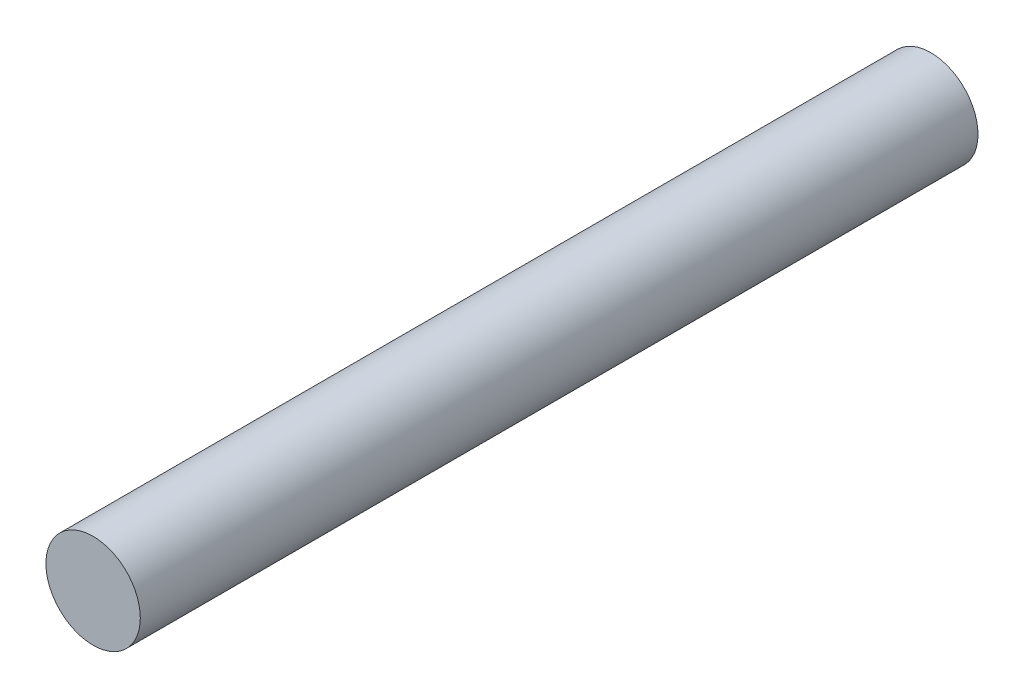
ISO-10303-21;
HEADER;
FILE_DESCRIPTION(('STEP AP214'),'2;1');
FILE_NAME('part.step','',(''),(''),'','','');
FILE_SCHEMA(('AUTOMOTIVE_DESIGN { 1 0 10303 214 1 1 1 1 }'));
ENDSEC;
DATA;
#1=APPLICATION_CONTEXT('core data for automotive mechanical design processes');
#2=APPLICATION_PROTOCOL_DEFINITION('international standard','automotive_design',2000,#1);
#3=PRODUCT_CONTEXT('',#1,'mechanical');
#4=PRODUCT('Part','Part','',(#3));
#5=PRODUCT_RELATED_PRODUCT_CATEGORY('part','',(#4));
#6=PRODUCT_DEFINITION_FORMATION('','',#4);
#7=PRODUCT_DEFINITION_CONTEXT('part definition',#1,'design');
#8=PRODUCT_DEFINITION('design','',#6,#7);
#9=PRODUCT_DEFINITION_SHAPE('','',#8);
#10=(LENGTH_UNIT() NAMED_UNIT(*) SI_UNIT(.MILLI.,.METRE.));
#11=(NAMED_UNIT(*) PLANE_ANGLE_UNIT() SI_UNIT($,.RADIAN.));
#12=(NAMED_UNIT(*) SI_UNIT($,.STERADIAN.) SOLID_ANGLE_UNIT());
#13=UNCERTAINTY_MEASURE_WITH_UNIT(LENGTH_MEASURE(1.E-05),#10,'distance_accuracy_value','');
#14=(GEOMETRIC_REPRESENTATION_CONTEXT(3) GLOBAL_UNCERTAINTY_ASSIGNED_CONTEXT((#13)) GLOBAL_UNIT_ASSIGNED_CONTEXT((#10,
#11,#12)) REPRESENTATION_CONTEXT('',''));
#15=CARTESIAN_POINT('',(0.,0.,0.));
#16=DIRECTION('',(0.,0.,1.));
#17=DIRECTION('',(1.,0.,0.));
#18=AXIS2_PLACEMENT_3D('',#15,#16,#17);
#19=CARTESIAN_POINT('',(-31.1913765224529,8.09595084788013,71.));
#20=DIRECTION('',(0.,0.,-1.));
#21=DIRECTION('',(-1.,0.,0.));
#22=AXIS2_PLACEMENT_3D('',#19,#20,#21);
#23=CYLINDRICAL_SURFACE('',#22,4.);
#24=CARTESIAN_POINT('',(-31.1913765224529,8.09595084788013,71.));
#25=DIRECTION('',(0.,0.,1.));
#26=DIRECTION('',(1.,0.,0.));
#27=AXIS2_PLACEMENT_3D('',#24,#25,#26);
#28=CIRCLE('',#27,4.);
#29=CARTESIAN_POINT('',(-27.1913765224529,8.09595084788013,71.));
#30=VERTEX_POINT('',#29);
#31=EDGE_CURVE('E10',#30,#30,#28,.T.);
#32=ORIENTED_EDGE('',*,*,#31,.F.);
#33=EDGE_LOOP('',(#32));
#34=FACE_BOUND('',#33,.T.);
#35=CARTESIAN_POINT('',(-31.1913765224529,8.09595084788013,0.));
#36=DIRECTION('',(0.,0.,1.));
#37=DIRECTION('',(1.,0.,0.));
#38=AXIS2_PLACEMENT_3D('',#35,#36,#37);
#39=CIRCLE('',#38,4.);
#40=CARTESIAN_POINT('',(-27.1913765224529,8.09595084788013,0.));
#41=VERTEX_POINT('',#40);
#42=EDGE_CURVE('E38',#41,#41,#39,.T.);
#43=ORIENTED_EDGE('',*,*,#42,.T.);
#44=EDGE_LOOP('',(#43));
#45=FACE_BOUND('',#44,.T.);
#46=ADVANCED_FACE('F35',(#34,#45),#23,.T.);
#47=CARTESIAN_POINT('',(-31.1913765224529,8.09595084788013,71.));
#48=DIRECTION('',(0.,0.,1.));
#49=DIRECTION('',(1.,0.,0.));
#50=AXIS2_PLACEMENT_3D('',#47,#48,#49);
#51=PLANE('',#50);
#52=ORIENTED_EDGE('',*,*,#31,.T.);
#53=EDGE_LOOP('',(#52));
#54=FACE_BOUND('',#53,.T.);
#55=ADVANCED_FACE('F50',(#54),#51,.T.);
#56=CARTESIAN_POINT('',(-31.1913765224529,8.09595084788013,0.));
#57=DIRECTION('',(0.,0.,1.));
#58=DIRECTION('',(1.,0.,0.));
#59=AXIS2_PLACEMENT_3D('',#56,#57,#58);
#60=PLANE('',#59);
#61=ORIENTED_EDGE('',*,*,#42,.F.);
#62=EDGE_LOOP('',(#61));
#63=FACE_BOUND('',#62,.T.);
#64=ADVANCED_FACE('F48',(#63),#60,.F.);
#65=CLOSED_SHELL('',(#46,#55,#64));
#66=MANIFOLD_SOLID_BREP('B2',#65);
#67=ADVANCED_BREP_SHAPE_REPRESENTATION('',(#18,#66),#14);
#68=SHAPE_DEFINITION_REPRESENTATION(#9,#67);
ENDSEC;
END-ISO-10303-21;
